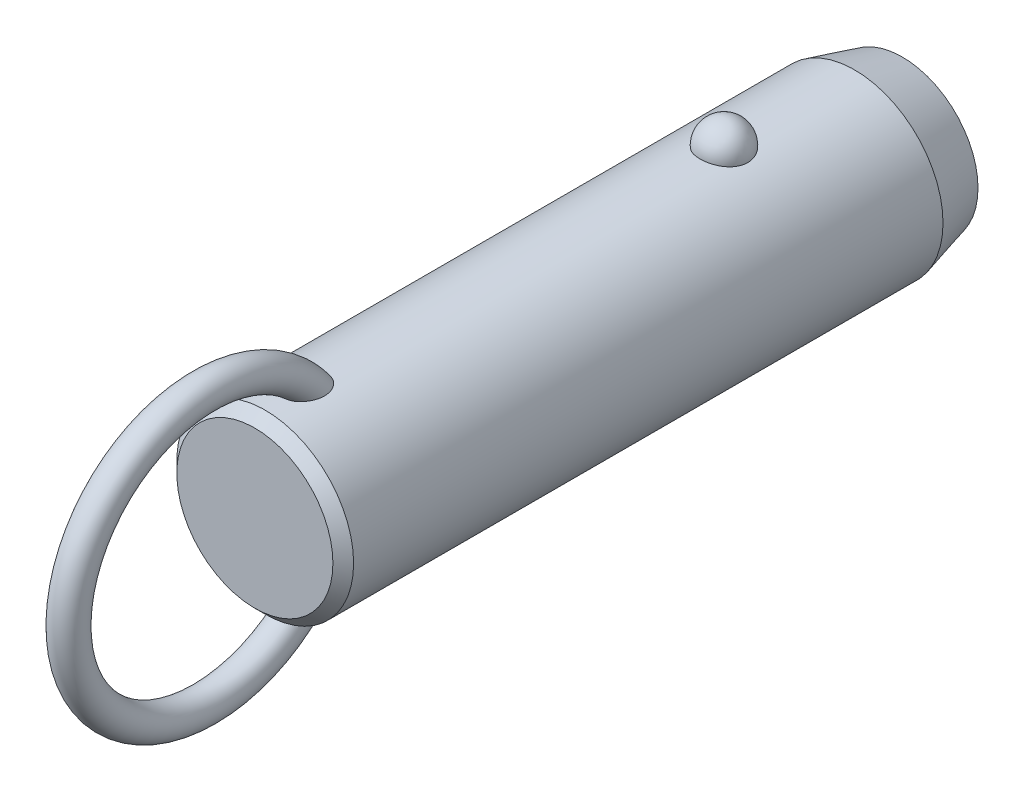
ISO-10303-21;
HEADER;
FILE_DESCRIPTION(('STEP AP214'),'2;1');
FILE_NAME('part.step','',(''),(''),'','','');
FILE_SCHEMA(('AUTOMOTIVE_DESIGN { 1 0 10303 214 1 1 1 1 }'));
ENDSEC;
DATA;
#1=APPLICATION_CONTEXT('core data for automotive mechanical design processes');
#2=APPLICATION_PROTOCOL_DEFINITION('international standard','automotive_design',2000,#1);
#3=PRODUCT_CONTEXT('',#1,'mechanical');
#4=PRODUCT('Part','Part','',(#3));
#5=PRODUCT_RELATED_PRODUCT_CATEGORY('part','',(#4));
#6=PRODUCT_DEFINITION_FORMATION('','',#4);
#7=PRODUCT_DEFINITION_CONTEXT('part definition',#1,'design');
#8=PRODUCT_DEFINITION('design','',#6,#7);
#9=PRODUCT_DEFINITION_SHAPE('','',#8);
#10=(LENGTH_UNIT() NAMED_UNIT(*) SI_UNIT(.MILLI.,.METRE.));
#11=(NAMED_UNIT(*) PLANE_ANGLE_UNIT() SI_UNIT($,.RADIAN.));
#12=(NAMED_UNIT(*) SI_UNIT($,.STERADIAN.) SOLID_ANGLE_UNIT());
#13=UNCERTAINTY_MEASURE_WITH_UNIT(LENGTH_MEASURE(1.E-05),#10,'distance_accuracy_value','');
#14=(GEOMETRIC_REPRESENTATION_CONTEXT(3) GLOBAL_UNCERTAINTY_ASSIGNED_CONTEXT((#13)) GLOBAL_UNIT_ASSIGNED_CONTEXT((#10,
#11,#12)) REPRESENTATION_CONTEXT('',''));
#15=CARTESIAN_POINT('',(0.,0.,0.));
#16=DIRECTION('',(0.,0.,1.));
#17=DIRECTION('',(1.,0.,0.));
#18=AXIS2_PLACEMENT_3D('',#15,#16,#17);
#19=CARTESIAN_POINT('',(0.,0.,43.2));
#20=DIRECTION('',(0.,0.,-1.));
#21=DIRECTION('',(-1.,0.,0.));
#22=AXIS2_PLACEMENT_3D('',#19,#20,#21);
#23=CYLINDRICAL_SURFACE('',#22,11.1);
#24=CARTESIAN_POINT('',(2.9724815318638,10.6945945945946,-3.));
#25=CARTESIAN_POINT('',(2.97247830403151,10.6945972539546,-2.83225059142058));
#26=CARTESIAN_POINT('',(2.95876598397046,10.6984356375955,-2.6644597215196));
#27=CARTESIAN_POINT('',(2.90424529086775,10.7133624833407,-2.33362381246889));
#28=CARTESIAN_POINT('',(2.8634252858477,10.7244540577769,-2.1705808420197));
#29=CARTESIAN_POINT('',(2.75573657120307,10.7526272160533,-1.85396767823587));
#30=CARTESIAN_POINT('',(2.68887937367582,10.7697061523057,-1.70039333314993));
#31=CARTESIAN_POINT('',(2.53079696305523,10.8079438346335,-1.40691598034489));
#32=CARTESIAN_POINT('',(2.43957264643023,10.8291024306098,-1.2670124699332));
#33=CARTESIAN_POINT('',(2.23458150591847,10.8732541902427,-1.00409565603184));
#34=CARTESIAN_POINT('',(2.12071295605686,10.8962553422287,-0.881162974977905));
#35=CARTESIAN_POINT('',(1.87365402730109,10.9414421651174,-0.656352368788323));
#36=CARTESIAN_POINT('',(1.74046358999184,10.9636278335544,-0.554474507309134));
#37=CARTESIAN_POINT('',(1.45872188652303,11.0046495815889,-0.374872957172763));
#38=CARTESIAN_POINT('',(1.31021276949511,11.0234944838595,-0.297085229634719));
#39=CARTESIAN_POINT('',(1.00170030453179,11.0557957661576,-0.16752977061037));
#40=CARTESIAN_POINT('',(0.841698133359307,11.0692526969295,-0.115759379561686));
#41=CARTESIAN_POINT('',(0.517607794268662,11.0890932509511,-0.040392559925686));
#42=CARTESIAN_POINT('',(0.353633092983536,11.0955916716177,-0.0163383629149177));
#43=CARTESIAN_POINT('',(0.0238420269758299,11.1011989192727,0.00445177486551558));
#44=CARTESIAN_POINT('',(-0.141974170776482,11.1003084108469,0.00119017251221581));
#45=CARTESIAN_POINT('',(-0.468405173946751,11.0912990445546,-0.0323233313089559));
#46=CARTESIAN_POINT('',(-0.629059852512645,11.0832767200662,-0.0622147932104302));
#47=CARTESIAN_POINT('',(-0.942937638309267,11.0609962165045,-0.147645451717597));
#48=CARTESIAN_POINT('',(-1.09616062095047,11.0467379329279,-0.203185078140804));
#49=CARTESIAN_POINT('',(-1.39181061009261,11.0134071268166,-0.3387529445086));
#50=CARTESIAN_POINT('',(-1.53417383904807,10.9943086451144,-0.418913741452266));
#51=CARTESIAN_POINT('',(-1.80342160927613,10.9533667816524,-0.601448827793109));
#52=CARTESIAN_POINT('',(-1.9303046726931,10.9315231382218,-0.703825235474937));
#53=CARTESIAN_POINT('',(-2.16747598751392,10.887005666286,-0.930091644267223));
#54=CARTESIAN_POINT('',(-2.27742774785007,10.8643239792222,-1.05433291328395));
#55=CARTESIAN_POINT('',(-2.47517316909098,10.8209886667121,-1.31966633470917));
#56=CARTESIAN_POINT('',(-2.56296538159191,10.8003351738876,-1.46075958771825));
#57=CARTESIAN_POINT('',(-2.71500300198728,10.7631304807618,-1.75753646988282));
#58=CARTESIAN_POINT('',(-2.77898901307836,10.7466250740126,-1.9133588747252));
#59=CARTESIAN_POINT('',(-2.88046189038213,10.7198747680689,-2.2339152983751));
#60=CARTESIAN_POINT('',(-2.91794947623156,10.709629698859,-2.39864907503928));
#61=CARTESIAN_POINT('',(-2.96537819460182,10.6965949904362,-2.73165170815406));
#62=CARTESIAN_POINT('',(-2.97542891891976,10.693775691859,-2.89990378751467));
#63=CARTESIAN_POINT('',(-2.96804271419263,10.6958279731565,-3.235752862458));
#64=CARTESIAN_POINT('',(-2.95060646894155,10.7006993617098,-3.40334987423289));
#65=CARTESIAN_POINT('',(-2.88883358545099,10.71753912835,-3.73233906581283));
#66=CARTESIAN_POINT('',(-2.84462026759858,10.7294749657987,-3.89375610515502));
#67=CARTESIAN_POINT('',(-2.73050447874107,10.7590797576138,-4.20667949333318));
#68=CARTESIAN_POINT('',(-2.66060103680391,10.7767489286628,-4.35818546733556));
#69=CARTESIAN_POINT('',(-2.49642559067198,10.8159599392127,-4.6478542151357));
#70=CARTESIAN_POINT('',(-2.40203047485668,10.8375211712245,-4.78594458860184));
#71=CARTESIAN_POINT('',(-2.19143488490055,10.8820570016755,-5.0441038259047));
#72=CARTESIAN_POINT('',(-2.07523364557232,10.9050316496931,-5.16417205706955));
#73=CARTESIAN_POINT('',(-1.82361254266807,10.9499219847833,-5.38334833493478));
#74=CARTESIAN_POINT('',(-1.68812945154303,10.9718338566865,-5.48238464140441));
#75=CARTESIAN_POINT('',(-1.40191298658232,11.0120611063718,-5.65618873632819));
#76=CARTESIAN_POINT('',(-1.25118062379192,11.0303767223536,-5.73095813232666));
#77=CARTESIAN_POINT('',(-0.940570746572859,11.0611653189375,-5.85334725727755));
#78=CARTESIAN_POINT('',(-0.780821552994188,11.0737044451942,-5.90127578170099));
#79=CARTESIAN_POINT('',(-0.455204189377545,11.0918598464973,-5.96992976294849));
#80=CARTESIAN_POINT('',(-0.289336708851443,11.0974768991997,-5.99065827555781));
#81=CARTESIAN_POINT('',(0.0406846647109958,11.1011307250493,-6.00418773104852));
#82=CARTESIAN_POINT('',(0.204817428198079,11.099299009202,-5.99747318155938));
#83=CARTESIAN_POINT('',(0.529553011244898,11.088551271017,-5.9574031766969));
#84=CARTESIAN_POINT('',(0.690155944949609,11.0796354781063,-5.92404858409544));
#85=CARTESIAN_POINT('',(1.0027760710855,11.0557204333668,-5.83180084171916));
#86=CARTESIAN_POINT('',(1.15482001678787,11.0407414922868,-5.77299291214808));
#87=CARTESIAN_POINT('',(1.44678373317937,11.0062913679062,-5.63147366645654));
#88=CARTESIAN_POINT('',(1.58670279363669,10.9868199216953,-5.54876095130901));
#89=CARTESIAN_POINT('',(1.8527023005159,10.9451315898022,-5.36027644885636));
#90=CARTESIAN_POINT('',(1.97855158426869,10.9228788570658,-5.25418644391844));
#91=CARTESIAN_POINT('',(2.21080872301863,10.8782509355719,-5.02251354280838));
#92=CARTESIAN_POINT('',(2.31721312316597,10.8558757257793,-4.89692718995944));
#93=CARTESIAN_POINT('',(2.5094551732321,10.8130715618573,-4.62745408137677));
#94=CARTESIAN_POINT('',(2.59493284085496,10.7926798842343,-4.48330448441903));
#95=CARTESIAN_POINT('',(2.740862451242,10.7565495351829,-4.18236358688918));
#96=CARTESIAN_POINT('',(2.80132490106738,10.7408089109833,-4.02557762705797));
#97=CARTESIAN_POINT('',(2.88959070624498,10.7173718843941,-3.72475308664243));
#98=CARTESIAN_POINT('',(2.92062102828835,10.7088950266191,-3.58171216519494));
#99=CARTESIAN_POINT('',(2.96206765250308,10.6975052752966,-3.29245795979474));
#100=CARTESIAN_POINT('',(2.97248434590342,10.6945922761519,-3.14624473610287));
#101=CARTESIAN_POINT('',(2.9724815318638,10.6945945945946,-3.));
#102=B_SPLINE_CURVE_WITH_KNOTS('',3,(#24,#25,#26,#27,#28,#29,#30,#31,#32,#33,#34,#35,#36,#37,
#38,#39,#40,#41,#42,#43,#44,#45,#46,#47,#48,#49,#50,#51,#52,#53,#54,#55,#56,#57,#58,#59,#60,#61,
#62,#63,#64,#65,#66,#67,#68,#69,#70,#71,#72,#73,#74,#75,#76,#77,#78,#79,#80,#81,#82,#83,#84,#85,
#86,#87,#88,#89,#90,#91,#92,#93,#94,#95,#96,#97,#98,#99,#100,#101),.UNSPECIFIED.,.T.,.F.,(4,2,2,
2,2,2,2,2,2,2,2,2,2,2,2,2,2,2,2,2,2,2,2,2,2,2,2,2,2,2,2,2,2,2,2,2,2,2,4),(0.,0.502722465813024,
1.00566079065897,1.5083769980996,2.01107471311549,2.51608392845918,3.02109467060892,
3.52475118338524,4.02835620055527,4.523518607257,5.0186364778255,5.50715297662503,
5.9956776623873,6.48688002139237,6.97812923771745,7.47814366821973,7.9781907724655,
8.48353712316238,8.9888697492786,9.49218093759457,9.99547960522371,10.4964777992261,
10.997494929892,11.5010810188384,12.0046847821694,12.5099796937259,13.0152411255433,
13.5145635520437,14.0138298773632,14.5043200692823,14.9947943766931,15.4836390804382,
15.9725123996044,16.4685040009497,16.9645836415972,17.4686765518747,17.972557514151,
18.410841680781,18.849117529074),.UNSPECIFIED.);
#103=CARTESIAN_POINT('',(2.9724815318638,10.6945945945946,-3.));
#104=VERTEX_POINT('',#103);
#105=EDGE_CURVE('E41',#104,#104,#102,.T.);
#106=ORIENTED_EDGE('',*,*,#105,.T.);
#107=EDGE_LOOP('',(#106));
#108=FACE_BOUND('',#107,.T.);
#109=CARTESIAN_POINT('',(0.,0.,54.6));
#110=DIRECTION('',(0.,0.,1.));
#111=DIRECTION('',(1.,0.,0.));
#112=AXIS2_PLACEMENT_3D('',#109,#110,#111);
#113=CIRCLE('',#112,11.1);
#114=CARTESIAN_POINT('',(11.1,0.,54.6));
#115=VERTEX_POINT('',#114);
#116=EDGE_CURVE('E10',#115,#115,#113,.F.);
#117=ORIENTED_EDGE('',*,*,#116,.T.);
#118=EDGE_LOOP('',(#117));
#119=FACE_BOUND('',#118,.T.);
#120=CARTESIAN_POINT('',(-0.56452033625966,-11.0856356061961,46.857815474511));
#121=CARTESIAN_POINT('',(-0.66720283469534,-11.0804062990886,46.8912839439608));
#122=CARTESIAN_POINT('',(-0.766875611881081,-11.0738877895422,46.9338357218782));
#123=CARTESIAN_POINT('',(-0.957284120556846,-11.0590576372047,47.0354190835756));
#124=CARTESIAN_POINT('',(-1.04801616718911,-11.0507452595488,47.0944574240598));
#125=CARTESIAN_POINT('',(-1.21800952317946,-11.0333016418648,47.2265293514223));
#126=CARTESIAN_POINT('',(-1.29730805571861,-11.0241732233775,47.2995156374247));
#127=CARTESIAN_POINT('',(-1.44337665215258,-11.0060026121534,47.4570374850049));
#128=CARTESIAN_POINT('',(-1.51014622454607,-10.9969604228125,47.5415734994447));
#129=CARTESIAN_POINT('',(-1.63454620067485,-10.9791841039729,47.7255213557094));
#130=CARTESIAN_POINT('',(-1.69127003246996,-10.9705107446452,47.8255493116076));
#131=CARTESIAN_POINT('',(-1.78980785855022,-10.9548648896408,48.0327902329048));
#132=CARTESIAN_POINT('',(-1.83161214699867,-10.9478935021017,48.1400078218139));
#133=CARTESIAN_POINT('',(-1.91557028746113,-10.9335803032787,48.4054080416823));
#134=CARTESIAN_POINT('',(-1.95040620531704,-10.9273269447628,48.5659806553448));
#135=CARTESIAN_POINT('',(-1.99388326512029,-10.9194709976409,48.8906977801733));
#136=CARTESIAN_POINT('',(-2.00248051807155,-10.9178762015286,49.0548478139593));
#137=CARTESIAN_POINT('',(-1.99551615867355,-10.9191578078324,49.4246504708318));
#138=CARTESIAN_POINT('',(-1.9732206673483,-10.9232807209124,49.6301911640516));
#139=CARTESIAN_POINT('',(-1.9152976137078,-10.9335244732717,49.933595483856));
#140=CARTESIAN_POINT('',(-1.89184575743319,-10.9376266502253,50.0340883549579));
#141=CARTESIAN_POINT('',(-1.83700674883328,-10.9469720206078,50.232855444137));
#142=CARTESIAN_POINT('',(-1.80562070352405,-10.9522150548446,50.3311299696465));
#143=CARTESIAN_POINT('',(-1.73463055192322,-10.9636837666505,50.5259148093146));
#144=CARTESIAN_POINT('',(-1.69493416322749,-10.9699202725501,50.6223907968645));
#145=CARTESIAN_POINT('',(-1.60745141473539,-10.9830806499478,50.8116262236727));
#146=CARTESIAN_POINT('',(-1.55966150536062,-10.9900048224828,50.9043840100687));
#147=CARTESIAN_POINT('',(-1.45591812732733,-11.0042280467,51.0846907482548));
#148=CARTESIAN_POINT('',(-1.40000013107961,-11.0115253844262,51.1722601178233));
#149=CARTESIAN_POINT('',(-1.2793747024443,-11.0261911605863,51.341029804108));
#150=CARTESIAN_POINT('',(-1.21467835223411,-11.0335594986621,51.4222379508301));
#151=CARTESIAN_POINT('',(-1.08218150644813,-11.0473027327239,51.5690010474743));
#152=CARTESIAN_POINT('',(-1.0152263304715,-11.0537063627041,51.6353092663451));
#153=CARTESIAN_POINT('',(-0.872952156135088,-11.065850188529,51.7583780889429));
#154=CARTESIAN_POINT('',(-0.797642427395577,-11.0715911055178,51.8151491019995));
#155=CARTESIAN_POINT('',(-0.651396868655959,-11.081071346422,51.9075155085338));
#156=CARTESIAN_POINT('',(-0.581712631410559,-11.0849841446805,51.9450491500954));
#157=CARTESIAN_POINT('',(-0.437066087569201,-11.0916271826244,52.0082594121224));
#158=CARTESIAN_POINT('',(-0.362109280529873,-11.0943586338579,52.0339481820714));
#159=CARTESIAN_POINT('',(-0.207828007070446,-11.0983242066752,52.071117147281));
#160=CARTESIAN_POINT('',(-0.128467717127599,-11.0995432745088,52.0824545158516));
#161=CARTESIAN_POINT('',(0.0309101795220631,-11.1002423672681,52.0889658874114));
#162=CARTESIAN_POINT('',(0.110927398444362,-11.0997233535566,52.0841488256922));
#163=CARTESIAN_POINT('',(0.256406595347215,-11.097240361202,52.0609599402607));
#164=CARTESIAN_POINT('',(0.322235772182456,-11.0955074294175,52.0447543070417));
#165=CARTESIAN_POINT('',(0.450635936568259,-11.0910350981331,52.0026008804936));
#166=CARTESIAN_POINT('',(0.513205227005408,-11.0882951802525,51.9766480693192));
#167=CARTESIAN_POINT('',(0.662626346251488,-11.0805620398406,51.9026073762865));
#168=CARTESIAN_POINT('',(0.747127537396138,-11.0751144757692,51.8498452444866));
#169=CARTESIAN_POINT('',(0.906756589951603,-11.0631932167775,51.7317206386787));
#170=CARTESIAN_POINT('',(0.981859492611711,-11.0567168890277,51.6663257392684));
#171=CARTESIAN_POINT('',(1.1071220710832,-11.0447856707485,51.5422633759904));
#172=CARTESIAN_POINT('',(1.15909566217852,-11.0394280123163,51.4853831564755));
#173=CARTESIAN_POINT('',(1.25791923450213,-11.0286040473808,51.3673271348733));
#174=CARTESIAN_POINT('',(1.30476642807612,-11.0231376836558,51.3061490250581));
#175=CARTESIAN_POINT('',(1.43818612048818,-11.0068027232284,51.117305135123));
#176=CARTESIAN_POINT('',(1.51751767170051,-10.9960104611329,50.9844531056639));
#177=CARTESIAN_POINT('',(1.63597546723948,-10.9788847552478,50.7531371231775));
#178=CARTESIAN_POINT('',(1.67988876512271,-10.9722190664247,50.6570530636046));
#179=CARTESIAN_POINT('',(1.75953241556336,-10.9597298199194,50.4614311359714));
#180=CARTESIAN_POINT('',(1.79525967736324,-10.9539065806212,50.3618919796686));
#181=CARTESIAN_POINT('',(1.85844731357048,-10.9433632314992,50.1602111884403));
#182=CARTESIAN_POINT('',(1.88591073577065,-10.9386427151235,50.0580705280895));
#183=CARTESIAN_POINT('',(1.93234324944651,-10.9305350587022,49.851819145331));
#184=CARTESIAN_POINT('',(1.95131065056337,-10.9271481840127,49.7477080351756));
#185=CARTESIAN_POINT('',(1.99040203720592,-10.9201183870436,49.4654588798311));
#186=CARTESIAN_POINT('',(2.00221217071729,-10.9179256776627,49.2860370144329));
#187=CARTESIAN_POINT('',(1.99711676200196,-10.9188636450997,48.9277133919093));
#188=CARTESIAN_POINT('',(1.98026150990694,-10.9219849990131,48.7488112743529));
#189=CARTESIAN_POINT('',(1.92151657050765,-10.9324473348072,48.4364514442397));
#190=CARTESIAN_POINT('',(1.88605081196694,-10.9386915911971,48.3017594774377));
#191=CARTESIAN_POINT('',(1.79393020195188,-10.9541780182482,48.0399669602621));
#192=CARTESIAN_POINT('',(1.73729868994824,-10.9634168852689,47.9128582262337));
#193=CARTESIAN_POINT('',(1.61237037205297,-10.9824218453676,47.6894184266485));
#194=CARTESIAN_POINT('',(1.54715374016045,-10.9918945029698,47.5913455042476));
#195=CARTESIAN_POINT('',(1.40127026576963,-11.0114415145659,47.4074341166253));
#196=CARTESIAN_POINT('',(1.3206074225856,-11.0215157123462,47.3215924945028));
#197=CARTESIAN_POINT('',(1.1447478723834,-11.041168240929,47.1651630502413));
#198=CARTESIAN_POINT('',(1.0494780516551,-11.0507437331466,47.0946565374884));
#199=CARTESIAN_POINT('',(0.847278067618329,-11.0680789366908,46.972640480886));
#200=CARTESIAN_POINT('',(0.740351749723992,-11.0758392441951,46.9211246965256));
#201=CARTESIAN_POINT('',(0.52928931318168,-11.0878275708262,46.8434852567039));
#202=CARTESIAN_POINT('',(0.425895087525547,-11.0923259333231,46.815377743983));
#203=CARTESIAN_POINT('',(0.215723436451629,-11.0984001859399,46.7777038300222));
#204=CARTESIAN_POINT('',(0.108947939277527,-11.0999777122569,46.7681270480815));
#205=CARTESIAN_POINT('',(-0.0938962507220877,-11.1000196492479,46.7678773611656));
#206=CARTESIAN_POINT('',(-0.189967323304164,-11.0987797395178,46.7754089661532));
#207=CARTESIAN_POINT('',(-0.3796579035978,-11.0939111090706,46.8055079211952));
#208=CARTESIAN_POINT('',(-0.473277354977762,-11.0902823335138,46.8280756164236));
#209=CARTESIAN_POINT('',(-0.56452033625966,-11.0856356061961,46.857815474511));
#210=B_SPLINE_CURVE_WITH_KNOTS('',3,(#120,#121,#122,#123,#124,#125,#126,#127,#128,#129,#130,
#131,#132,#133,#134,#135,#136,#137,#138,#139,#140,#141,#142,#143,#144,#145,#146,#147,#148,#149,
#150,#151,#152,#153,#154,#155,#156,#157,#158,#159,#160,#161,#162,#163,#164,#165,#166,#167,#168,
#169,#170,#171,#172,#173,#174,#175,#176,#177,#178,#179,#180,#181,#182,#183,#184,#185,#186,#187,
#188,#189,#190,#191,#192,#193,#194,#195,#196,#197,#198,#199,#200,#201,#202,#203,#204,#205,#206,
#207,#208,#209),.UNSPECIFIED.,.T.,.F.,(4,2,2,2,2,2,2,2,2,2,2,2,2,2,2,2,2,2,2,2,2,2,2,2,2,2,2,2,
2,2,2,2,2,2,2,2,2,2,2,2,2,2,2,2,4),(0.,0.323999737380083,0.648132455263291,0.971184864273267,
1.29424994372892,1.63886237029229,1.98369857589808,2.4742605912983,2.96564271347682,
3.58257396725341,3.89215258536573,4.20168803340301,4.51486273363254,4.82817514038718,
5.14015911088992,5.45175282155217,5.734428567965,6.01679375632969,6.25364580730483,
6.49025437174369,6.72919963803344,6.9680127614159,7.17061258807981,7.37331685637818,
7.67094989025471,7.96935728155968,8.20075067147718,8.4322692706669,8.8958162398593,
9.21306533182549,9.53043400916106,9.84768549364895,10.1650000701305,10.70229304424,
11.2386443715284,11.6553390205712,12.0715755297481,12.4245637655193,12.7774607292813,
13.1321855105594,13.4867936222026,13.8068771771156,14.1267813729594,14.4146787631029,
14.7025827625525),.UNSPECIFIED.);
#211=CARTESIAN_POINT('',(-0.56452033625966,-11.0856356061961,46.857815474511));
#212=VERTEX_POINT('',#211);
#213=EDGE_CURVE('E60',#212,#212,#210,.T.);
#214=ORIENTED_EDGE('',*,*,#213,.T.);
#215=EDGE_LOOP('',(#214));
#216=FACE_BOUND('',#215,.T.);
#217=CARTESIAN_POINT('',(-0.56452033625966,11.0856356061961,46.857815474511));
#218=CARTESIAN_POINT('',(-0.468542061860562,11.0905203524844,46.8265456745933));
#219=CARTESIAN_POINT('',(-0.369793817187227,11.0942886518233,46.8031576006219));
#220=CARTESIAN_POINT('',(-0.169555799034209,11.0991586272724,46.7730858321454));
#221=CARTESIAN_POINT('',(-0.0680604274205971,11.1002543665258,46.7664393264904));
#222=CARTESIAN_POINT('',(0.134549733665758,11.099646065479,46.7701579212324));
#223=CARTESIAN_POINT('',(0.235664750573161,11.0979441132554,46.7805103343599));
#224=CARTESIAN_POINT('',(0.434632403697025,11.0919342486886,46.8178318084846));
#225=CARTESIAN_POINT('',(0.532486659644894,11.0876276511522,46.8447924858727));
#226=CARTESIAN_POINT('',(0.722445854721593,11.0768742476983,46.9144096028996));
#227=CARTESIAN_POINT('',(0.814543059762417,11.0704246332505,46.9570866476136));
#228=CARTESIAN_POINT('',(0.990565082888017,11.0560659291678,47.0566487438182));
#229=CARTESIAN_POINT('',(1.07448844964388,11.048156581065,47.1135363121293));
#230=CARTESIAN_POINT('',(1.23562672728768,11.0313221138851,47.2422106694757));
#231=CARTESIAN_POINT('',(1.31242684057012,11.0223686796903,47.3145117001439));
#232=CARTESIAN_POINT('',(1.45398030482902,11.0045918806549,47.4700425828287));
#233=CARTESIAN_POINT('',(1.51873073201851,10.9957685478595,47.5532750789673));
#234=CARTESIAN_POINT('',(1.64107232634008,10.9782087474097,47.7363842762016));
#235=CARTESIAN_POINT('',(1.6974317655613,10.9695572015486,47.8370893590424));
#236=CARTESIAN_POINT('',(1.79515063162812,10.9539887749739,48.0456264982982));
#237=CARTESIAN_POINT('',(1.83649966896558,10.9470730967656,48.1534634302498));
#238=CARTESIAN_POINT('',(1.91931148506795,10.9329211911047,48.4203995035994));
#239=CARTESIAN_POINT('',(1.95340104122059,10.9267904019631,48.5818612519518));
#240=CARTESIAN_POINT('',(1.99526195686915,10.9192174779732,48.9082163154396));
#241=CARTESIAN_POINT('',(2.00298989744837,10.9177830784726,49.0731148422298));
#242=CARTESIAN_POINT('',(1.99396251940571,10.9194420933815,49.4441006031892));
#243=CARTESIAN_POINT('',(1.97050829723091,10.923774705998,49.6500387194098));
#244=CARTESIAN_POINT('',(1.91079643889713,10.9343131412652,49.9539019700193));
#245=CARTESIAN_POINT('',(1.8867370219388,10.9385106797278,50.0545296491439));
#246=CARTESIAN_POINT('',(1.83065508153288,10.9480376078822,50.2535107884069));
#247=CARTESIAN_POINT('',(1.79863369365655,10.9533668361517,50.351864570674));
#248=CARTESIAN_POINT('',(1.72633365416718,10.9649954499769,50.5467203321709));
#249=CARTESIAN_POINT('',(1.68596409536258,10.9713053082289,50.6431879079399));
#250=CARTESIAN_POINT('',(1.59707998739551,10.9845964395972,50.8323233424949));
#251=CARTESIAN_POINT('',(1.54856169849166,10.9915780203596,50.9249894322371));
#252=CARTESIAN_POINT('',(1.4433016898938,11.0058935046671,51.1049752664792));
#253=CARTESIAN_POINT('',(1.38659749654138,11.0132257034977,51.192316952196));
#254=CARTESIAN_POINT('',(1.26431158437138,11.0279330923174,51.3604563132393));
#255=CARTESIAN_POINT('',(1.198741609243,11.0353082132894,51.4412624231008));
#256=CARTESIAN_POINT('',(1.06542088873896,11.048931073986,51.5859856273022));
#257=CARTESIAN_POINT('',(0.998640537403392,11.0552153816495,51.650784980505));
#258=CARTESIAN_POINT('',(0.856896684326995,11.0671032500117,51.7708462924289));
#259=CARTESIAN_POINT('',(0.781942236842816,11.0727075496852,51.8261186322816));
#260=CARTESIAN_POINT('',(0.636276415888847,11.081949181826,51.9159721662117));
#261=CARTESIAN_POINT('',(0.566755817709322,11.0857572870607,51.9524410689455));
#262=CARTESIAN_POINT('',(0.422602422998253,11.0921860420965,52.0135333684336));
#263=CARTESIAN_POINT('',(0.347974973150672,11.0948079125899,52.0381689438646));
#264=CARTESIAN_POINT('',(0.194593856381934,11.0985608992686,52.0733233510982));
#265=CARTESIAN_POINT('',(0.11580793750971,11.0996777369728,52.0837069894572));
#266=CARTESIAN_POINT('',(-0.042249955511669,11.1002003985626,52.0885747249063));
#267=CARTESIAN_POINT('',(-0.121521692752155,11.09960699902,52.083066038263));
#268=CARTESIAN_POINT('',(-0.266046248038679,11.0970123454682,52.0588271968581));
#269=CARTESIAN_POINT('',(-0.331661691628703,11.0952283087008,52.0421356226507));
#270=CARTESIAN_POINT('',(-0.459588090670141,11.0906663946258,51.9991117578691));
#271=CARTESIAN_POINT('',(-0.521897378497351,11.0878880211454,51.972774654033));
#272=CARTESIAN_POINT('',(-0.67144642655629,11.0800342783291,51.8975130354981));
#273=CARTESIAN_POINT('',(-0.756250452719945,11.0744969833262,51.843818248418));
#274=CARTESIAN_POINT('',(-0.916349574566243,11.0624045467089,51.7238029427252));
#275=CARTESIAN_POINT('',(-0.991618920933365,11.0558467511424,51.6574493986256));
#276=CARTESIAN_POINT('',(-1.11713140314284,11.0437783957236,51.5316335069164));
#277=CARTESIAN_POINT('',(-1.16920539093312,11.0383619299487,51.4739524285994));
#278=CARTESIAN_POINT('',(-1.26817476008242,11.02743010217,51.3542809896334));
#279=CARTESIAN_POINT('',(-1.315067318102,11.0219146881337,51.2922883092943));
#280=CARTESIAN_POINT('',(-1.40399813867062,11.0109399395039,51.1647843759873));
#281=CARTESIAN_POINT('',(-1.4460286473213,11.0054807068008,51.0992677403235));
#282=CARTESIAN_POINT('',(-1.52538779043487,10.9947621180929,50.9654223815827));
#283=CARTESIAN_POINT('',(-1.56271516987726,10.9895028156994,50.8970929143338));
#284=CARTESIAN_POINT('',(-1.64537943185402,10.9774790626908,50.7332101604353));
#285=CARTESIAN_POINT('',(-1.68879497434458,10.9708503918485,50.6366735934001));
#286=CARTESIAN_POINT('',(-1.76740738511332,10.9584602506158,50.4402369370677));
#287=CARTESIAN_POINT('',(-1.80260120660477,10.95269910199,50.3403356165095));
#288=CARTESIAN_POINT('',(-1.86468657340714,10.9423003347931,50.1379663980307));
#289=CARTESIAN_POINT('',(-1.8915816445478,10.9376622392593,50.0354996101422));
#290=CARTESIAN_POINT('',(-1.93682458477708,10.9297405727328,49.8286429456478));
#291=CARTESIAN_POINT('',(-1.95517082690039,10.9264572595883,49.7242527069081));
#292=CARTESIAN_POINT('',(-1.99232562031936,10.9197647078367,49.4426287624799));
#293=CARTESIAN_POINT('',(-2.00294603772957,10.9177914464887,49.2641857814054));
#294=CARTESIAN_POINT('',(-1.99566675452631,10.9191290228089,48.9079962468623));
#295=CARTESIAN_POINT('',(-1.97781651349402,10.9224306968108,48.7302490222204));
#296=CARTESIAN_POINT('',(-1.91747214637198,10.9331592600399,48.4197921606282));
#297=CARTESIAN_POINT('',(-1.88131022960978,10.9395108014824,48.285825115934));
#298=CARTESIAN_POINT('',(-1.78790380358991,10.9551659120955,48.0255975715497));
#299=CARTESIAN_POINT('',(-1.73068309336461,10.9644661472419,47.8993285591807));
#300=CARTESIAN_POINT('',(-1.60475573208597,10.9835398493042,47.6774156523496));
#301=CARTESIAN_POINT('',(-1.53908879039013,10.9930297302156,47.5800265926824));
#302=CARTESIAN_POINT('',(-1.39238608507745,11.0125708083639,47.3975250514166));
#303=CARTESIAN_POINT('',(-1.31135150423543,11.0226219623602,47.3124116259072));
#304=CARTESIAN_POINT('',(-1.14382035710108,11.0411991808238,47.1652994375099));
#305=CARTESIAN_POINT('',(-1.05858500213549,11.0497792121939,47.1018693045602));
#306=CARTESIAN_POINT('',(-0.878723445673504,11.0655285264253,46.9902505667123));
#307=CARTESIAN_POINT('',(-0.784123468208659,11.0727015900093,46.9420208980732));
#308=CARTESIAN_POINT('',(-0.646163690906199,11.0812501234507,46.886023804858));
#309=CARTESIAN_POINT('',(-0.605595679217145,11.0835451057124,46.8711978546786));
#310=CARTESIAN_POINT('',(-0.56452033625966,11.0856356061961,46.857815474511));
#311=B_SPLINE_CURVE_WITH_KNOTS('',3,(#217,#218,#219,#220,#221,#222,#223,#224,#225,#226,#227,
#228,#229,#230,#231,#232,#233,#234,#235,#236,#237,#238,#239,#240,#241,#242,#243,#244,#245,#246,
#247,#248,#249,#250,#251,#252,#253,#254,#255,#256,#257,#258,#259,#260,#261,#262,#263,#264,#265,
#266,#267,#268,#269,#270,#271,#272,#273,#274,#275,#276,#277,#278,#279,#280,#281,#282,#283,#284,
#285,#286,#287,#288,#289,#290,#291,#292,#293,#294,#295,#296,#297,#298,#299,#300,#301,#302,#303,
#304,#305,#306,#307,#308,#309,#310),.UNSPECIFIED.,.T.,.F.,(4,2,2,2,2,2,2,2,2,2,2,2,2,2,2,2,2,2,
2,2,2,2,2,2,2,2,2,2,2,2,2,2,2,2,2,2,2,2,2,2,2,2,2,2,2,2,4),(0.,0.303061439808,0.606795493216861,
0.910302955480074,1.21365733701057,1.51741085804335,1.82121821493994,2.13745205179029,
2.45376252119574,2.799586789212,3.14564996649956,3.63832391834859,4.13180893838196,
4.75031912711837,5.06071926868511,5.37107516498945,5.68500772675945,5.99908475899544,
6.3117651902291,6.62403542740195,6.90315673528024,7.18197194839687,7.41687778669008,
7.6515413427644,7.8884158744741,8.12518286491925,8.32752842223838,8.52997509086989,
8.82986421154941,9.13054668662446,9.36393502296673,9.59744991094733,9.83133221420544,
10.0652767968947,10.383032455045,10.7009056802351,11.0186436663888,11.3364420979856,
11.8705925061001,12.4038159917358,12.8189662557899,13.2336487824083,13.5857049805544,
13.9377340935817,14.2561354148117,14.5736690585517,14.7033687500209),.UNSPECIFIED.);
#312=CARTESIAN_POINT('',(-0.56452033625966,11.0856356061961,46.857815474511));
#313=VERTEX_POINT('',#312);
#314=EDGE_CURVE('E67',#313,#313,#311,.T.);
#315=ORIENTED_EDGE('',*,*,#314,.T.);
#316=EDGE_LOOP('',(#315));
#317=FACE_BOUND('',#316,.T.);
#318=CARTESIAN_POINT('',(0.,0.,-19.4));
#319=DIRECTION('',(0.,0.,-1.));
#320=DIRECTION('',(-1.,0.,0.));
#321=AXIS2_PLACEMENT_3D('',#318,#319,#320);
#322=CIRCLE('',#321,11.1);
#323=CARTESIAN_POINT('',(11.1,0.,-19.4));
#324=VERTEX_POINT('',#323);
#325=EDGE_CURVE('E57',#324,#324,#322,.F.);
#326=ORIENTED_EDGE('',*,*,#325,.T.);
#327=EDGE_LOOP('',(#326));
#328=FACE_BOUND('',#327,.T.);
#329=ADVANCED_FACE('F37',(#108,#119,#216,#317,#328),#23,.T.);
#330=CARTESIAN_POINT('',(0.,0.,-25.4));
#331=DIRECTION('',(0.,0.,-1.));
#332=DIRECTION('',(-1.,0.,0.));
#333=AXIS2_PLACEMENT_3D('',#330,#331,#332);
#334=PLANE('',#333);
#335=CARTESIAN_POINT('',(0.,0.,-25.4));
#336=DIRECTION('',(0.,0.,-1.));
#337=DIRECTION('',(-1.,0.,0.));
#338=AXIS2_PLACEMENT_3D('',#335,#336,#337);
#339=CIRCLE('',#338,9.49230484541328);
#340=CARTESIAN_POINT('',(9.49230484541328,0.,-25.4));
#341=VERTEX_POINT('',#340);
#342=EDGE_CURVE('E66',#341,#341,#339,.T.);
#343=ORIENTED_EDGE('',*,*,#342,.T.);
#344=EDGE_LOOP('',(#343));
#345=FACE_BOUND('',#344,.T.);
#346=ADVANCED_FACE('F85',(#345),#334,.T.);
#347=CARTESIAN_POINT('',(0.,0.,-25.4));
#348=DIRECTION('',(0.,0.,1.));
#349=DIRECTION('',(1.,0.,0.));
#350=AXIS2_PLACEMENT_3D('',#347,#348,#349);
#351=CONICAL_SURFACE('',#350,9.49230484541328,0.261799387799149);
#352=CARTESIAN_POINT('',(11.1,0.,-19.4));
#353=CARTESIAN_POINT('',(11.0832531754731,0.,-19.4625));
#354=CARTESIAN_POINT('',(11.0665063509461,0.,-19.525));
#355=CARTESIAN_POINT('',(11.0330127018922,0.,-19.65));
#356=CARTESIAN_POINT('',(11.0162658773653,0.,-19.7125));
#357=CARTESIAN_POINT('',(10.9827722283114,0.,-19.8375));
#358=CARTESIAN_POINT('',(10.9660254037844,0.,-19.9));
#359=CARTESIAN_POINT('',(10.9325317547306,0.,-20.025));
#360=CARTESIAN_POINT('',(10.9157849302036,0.,-20.0875));
#361=CARTESIAN_POINT('',(10.8822912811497,0.,-20.2125));
#362=CARTESIAN_POINT('',(10.8655444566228,0.,-20.275));
#363=CARTESIAN_POINT('',(10.8320508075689,0.,-20.4));
#364=CARTESIAN_POINT('',(10.8153039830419,0.,-20.4625));
#365=CARTESIAN_POINT('',(10.781810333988,0.,-20.5875));
#366=CARTESIAN_POINT('',(10.7650635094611,0.,-20.65));
#367=CARTESIAN_POINT('',(10.7315698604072,0.,-20.775));
#368=CARTESIAN_POINT('',(10.7148230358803,0.,-20.8375));
#369=CARTESIAN_POINT('',(10.6813293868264,0.,-20.9625));
#370=CARTESIAN_POINT('',(10.6645825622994,0.,-21.025));
#371=CARTESIAN_POINT('',(10.6310889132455,0.,-21.15));
#372=CARTESIAN_POINT('',(10.6143420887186,0.,-21.2125));
#373=CARTESIAN_POINT('',(10.5808484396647,0.,-21.3375));
#374=CARTESIAN_POINT('',(10.5641016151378,0.,-21.4));
#375=CARTESIAN_POINT('',(10.5306079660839,0.,-21.525));
#376=CARTESIAN_POINT('',(10.5138611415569,0.,-21.5875));
#377=CARTESIAN_POINT('',(10.480367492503,0.,-21.7125));
#378=CARTESIAN_POINT('',(10.4636206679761,0.,-21.775));
#379=CARTESIAN_POINT('',(10.4301270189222,0.,-21.9));
#380=CARTESIAN_POINT('',(10.4133801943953,0.,-21.9625));
#381=CARTESIAN_POINT('',(10.3798865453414,0.,-22.0875));
#382=CARTESIAN_POINT('',(10.3631397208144,0.,-22.15));
#383=CARTESIAN_POINT('',(10.3296460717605,0.,-22.275));
#384=CARTESIAN_POINT('',(10.3128992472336,0.,-22.3375));
#385=CARTESIAN_POINT('',(10.2794055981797,0.,-22.4625));
#386=CARTESIAN_POINT('',(10.2626587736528,0.,-22.525));
#387=CARTESIAN_POINT('',(10.2291651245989,0.,-22.65));
#388=CARTESIAN_POINT('',(10.2124183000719,0.,-22.7125));
#389=CARTESIAN_POINT('',(10.178924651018,0.,-22.8375));
#390=CARTESIAN_POINT('',(10.1621778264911,0.,-22.9));
#391=CARTESIAN_POINT('',(10.1286841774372,0.,-23.025));
#392=CARTESIAN_POINT('',(10.1119373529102,0.,-23.0875));
#393=CARTESIAN_POINT('',(10.0784437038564,0.,-23.2125));
#394=CARTESIAN_POINT('',(10.0616968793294,0.,-23.275));
#395=CARTESIAN_POINT('',(10.0282032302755,0.,-23.4));
#396=CARTESIAN_POINT('',(10.0114564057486,0.,-23.4625));
#397=CARTESIAN_POINT('',(9.97796275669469,0.,-23.5875));
#398=CARTESIAN_POINT('',(9.96121593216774,0.,-23.65));
#399=CARTESIAN_POINT('',(9.92772228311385,0.,-23.775));
#400=CARTESIAN_POINT('',(9.91097545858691,0.,-23.8375));
#401=CARTESIAN_POINT('',(9.87748180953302,0.,-23.9625));
#402=CARTESIAN_POINT('',(9.86073498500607,0.,-24.025));
#403=CARTESIAN_POINT('',(9.82724133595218,0.,-24.15));
#404=CARTESIAN_POINT('',(9.81049451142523,0.,-24.2125));
#405=CARTESIAN_POINT('',(9.77700086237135,0.,-24.3375));
#406=CARTESIAN_POINT('',(9.7602540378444,0.,-24.4));
#407=CARTESIAN_POINT('',(9.72676038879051,0.,-24.525));
#408=CARTESIAN_POINT('',(9.71001356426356,0.,-24.5875));
#409=CARTESIAN_POINT('',(9.67651991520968,0.,-24.7125));
#410=CARTESIAN_POINT('',(9.65977309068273,0.,-24.775));
#411=CARTESIAN_POINT('',(9.62627944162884,0.,-24.9));
#412=CARTESIAN_POINT('',(9.60953261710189,0.,-24.9625));
#413=CARTESIAN_POINT('',(9.576038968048,0.,-25.0875));
#414=CARTESIAN_POINT('',(9.55929214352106,0.,-25.15));
#415=CARTESIAN_POINT('',(9.52579849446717,0.,-25.275));
#416=CARTESIAN_POINT('',(9.50905166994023,0.,-25.3375));
#417=CARTESIAN_POINT('',(9.49230484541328,0.,-25.4));
#418=B_SPLINE_CURVE_WITH_KNOTS('',3,(#352,#353,#354,#355,#356,#357,#358,#359,#360,#361,#362,
#363,#364,#365,#366,#367,#368,#369,#370,#371,#372,#373,#374,#375,#376,#377,#378,#379,#380,#381,
#382,#383,#384,#385,#386,#387,#388,#389,#390,#391,#392,#393,#394,#395,#396,#397,#398,#399,#400,
#401,#402,#403,#404,#405,#406,#407,#408,#409,#410,#411,#412,#413,#414,#415,#416,#417),
.UNSPECIFIED.,.F.,.F.,(4,2,2,2,2,2,2,2,2,2,2,2,2,2,2,2,2,2,2,2,2,2,2,2,2,2,2,2,2,2,2,2,4),(0.,
0.194114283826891,0.388228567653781,0.582342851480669,0.776457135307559,0.97057141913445,
1.16468570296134,1.35879998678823,1.55291427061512,1.74702855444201,1.9411428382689,
2.13525712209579,2.32937140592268,2.52348568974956,2.71759997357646,2.91171425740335,
3.10582854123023,3.29994282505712,3.49405710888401,3.68817139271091,3.88228567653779,
4.07639996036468,4.27051424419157,4.46462852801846,4.65874281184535,4.85285709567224,
5.04697137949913,5.24108566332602,5.43519994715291,5.6293142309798,5.82342851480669,
6.01754279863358,6.21165708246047),.UNSPECIFIED.);
#419=EDGE_CURVE('BSEAM83',#324,#341,#418,.T.);
#420=ORIENTED_EDGE('',*,*,#325,.F.);
#421=ORIENTED_EDGE('',*,*,#342,.F.);
#422=ORIENTED_EDGE('',*,*,#419,.T.);
#423=ORIENTED_EDGE('',*,*,#419,.F.);
#424=EDGE_LOOP('',(#420,#422,#421,#423));
#425=FACE_BOUND('',#424,.T.);
#426=ADVANCED_FACE('F83',(#425),#351,.T.);
#427=CARTESIAN_POINT('',(0.,0.,55.9));
#428=DIRECTION('',(0.,0.,1.));
#429=DIRECTION('',(1.,0.,0.));
#430=AXIS2_PLACEMENT_3D('',#427,#428,#429);
#431=PLANE('',#430);
#432=CARTESIAN_POINT('',(0.,0.,55.9));
#433=DIRECTION('',(0.,0.,1.));
#434=DIRECTION('',(1.,0.,0.));
#435=AXIS2_PLACEMENT_3D('',#432,#433,#434);
#436=CIRCLE('',#435,9.80000000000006);
#437=CARTESIAN_POINT('',(9.80000000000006,0.,55.9));
#438=VERTEX_POINT('',#437);
#439=EDGE_CURVE('E50',#438,#438,#436,.T.);
#440=ORIENTED_EDGE('',*,*,#439,.T.);
#441=EDGE_LOOP('',(#440));
#442=FACE_BOUND('',#441,.T.);
#443=ADVANCED_FACE('F77',(#442),#431,.T.);
#444=CARTESIAN_POINT('',(0.,0.,62.25));
#445=DIRECTION('',(1.,0.,0.));
#446=DIRECTION('',(0.,0.,-1.));
#447=AXIS2_PLACEMENT_3D('',#444,#445,#446);
#448=TOROIDAL_SURFACE('',#447,17.05,2.);
#449=ORIENTED_EDGE('',*,*,#314,.F.);
#450=EDGE_LOOP('',(#449));
#451=FACE_BOUND('',#450,.T.);
#452=ORIENTED_EDGE('',*,*,#213,.F.);
#453=EDGE_LOOP('',(#452));
#454=FACE_BOUND('',#453,.T.);
#455=ADVANCED_FACE('F73',(#451,#454),#448,.T.);
#456=CARTESIAN_POINT('',(0.,0.,55.9));
#457=DIRECTION('',(0.,0.,-1.));
#458=DIRECTION('',(-1.,0.,0.));
#459=AXIS2_PLACEMENT_3D('',#456,#457,#458);
#460=CONICAL_SURFACE('',#459,9.80000000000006,0.785398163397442);
#461=ORIENTED_EDGE('',*,*,#116,.F.);
#462=EDGE_LOOP('',(#461));
#463=FACE_BOUND('',#462,.T.);
#464=ORIENTED_EDGE('',*,*,#439,.F.);
#465=EDGE_LOOP('',(#464));
#466=FACE_BOUND('',#465,.T.);
#467=ADVANCED_FACE('F39',(#463,#466),#460,.T.);
#468=CARTESIAN_POINT('',(0.,11.1,-3.));
#469=DIRECTION('',(0.,1.,0.));
#470=DIRECTION('',(0.,0.,-1.));
#471=AXIS2_PLACEMENT_3D('',#468,#469,#470);
#472=SPHERICAL_SURFACE('',#471,3.);
#473=ORIENTED_EDGE('',*,*,#105,.F.);
#474=EDGE_LOOP('',(#473));
#475=FACE_BOUND('',#474,.T.);
#476=ADVANCED_FACE('F79',(#475),#472,.T.);
#477=CLOSED_SHELL('',(#329,#346,#426,#443,#455,#467,#476));
#478=MANIFOLD_SOLID_BREP('B2',#477);
#479=ADVANCED_BREP_SHAPE_REPRESENTATION('',(#18,#478),#14);
#480=SHAPE_DEFINITION_REPRESENTATION(#9,#479);
ENDSEC;
END-ISO-10303-21;
